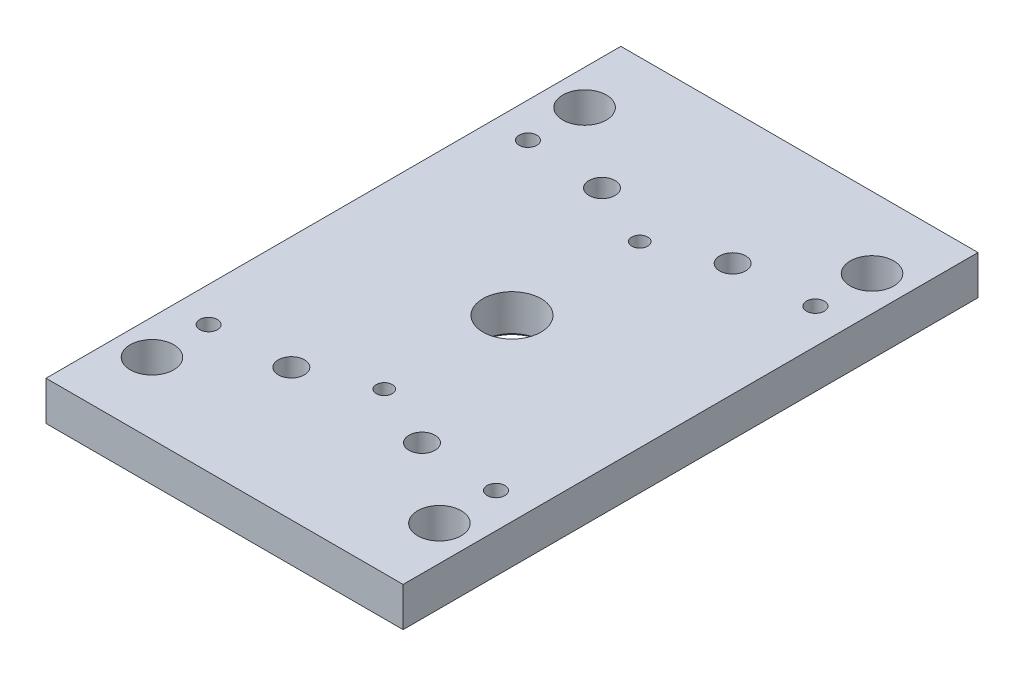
ISO-10303-21;
HEADER;
FILE_DESCRIPTION(('STEP AP214'),'2;1');
FILE_NAME('part.step','',(''),(''),'','','');
FILE_SCHEMA(('AUTOMOTIVE_DESIGN { 1 0 10303 214 1 1 1 1 }'));
ENDSEC;
DATA;
#1=APPLICATION_CONTEXT('core data for automotive mechanical design processes');
#2=APPLICATION_PROTOCOL_DEFINITION('international standard','automotive_design',2000,#1);
#3=PRODUCT_CONTEXT('',#1,'mechanical');
#4=PRODUCT('Part','Part','',(#3));
#5=PRODUCT_RELATED_PRODUCT_CATEGORY('part','',(#4));
#6=PRODUCT_DEFINITION_FORMATION('','',#4);
#7=PRODUCT_DEFINITION_CONTEXT('part definition',#1,'design');
#8=PRODUCT_DEFINITION('design','',#6,#7);
#9=PRODUCT_DEFINITION_SHAPE('','',#8);
#10=(LENGTH_UNIT() NAMED_UNIT(*) SI_UNIT(.MILLI.,.METRE.));
#11=(NAMED_UNIT(*) PLANE_ANGLE_UNIT() SI_UNIT($,.RADIAN.));
#12=(NAMED_UNIT(*) SI_UNIT($,.STERADIAN.) SOLID_ANGLE_UNIT());
#13=UNCERTAINTY_MEASURE_WITH_UNIT(LENGTH_MEASURE(1.E-05),#10,'distance_accuracy_value','');
#14=(GEOMETRIC_REPRESENTATION_CONTEXT(3) GLOBAL_UNCERTAINTY_ASSIGNED_CONTEXT((#13)) GLOBAL_UNIT_ASSIGNED_CONTEXT((#10,
#11,#12)) REPRESENTATION_CONTEXT('',''));
#15=CARTESIAN_POINT('',(0.,0.,0.));
#16=DIRECTION('',(0.,0.,1.));
#17=DIRECTION('',(1.,0.,0.));
#18=AXIS2_PLACEMENT_3D('',#15,#16,#17);
#19=CARTESIAN_POINT('',(-33.868,-153.,160.868));
#20=DIRECTION('',(0.,1.,0.));
#21=DIRECTION('',(-1.,0.,0.));
#22=AXIS2_PLACEMENT_3D('',#19,#20,#21);
#23=PLANE('',#22);
#24=CARTESIAN_POINT('',(-45.,-153.,172.));
#25=DIRECTION('',(0.,1.,0.));
#26=DIRECTION('',(0.,0.,1.));
#27=AXIS2_PLACEMENT_3D('',#24,#25,#26);
#28=CIRCLE('',#27,8.99999999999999);
#29=CARTESIAN_POINT('',(-45.,-153.,181.));
#30=VERTEX_POINT('',#29);
#31=EDGE_CURVE('E206',#30,#30,#28,.F.);
#32=ORIENTED_EDGE('',*,*,#31,.F.);
#33=EDGE_LOOP('',(#32));
#34=FACE_BOUND('',#33,.T.);
#35=CARTESIAN_POINT('',(-45.,-153.,172.));
#36=DIRECTION('',(0.,1.,0.));
#37=DIRECTION('',(0.,0.,1.));
#38=AXIS2_PLACEMENT_3D('',#35,#36,#37);
#39=CIRCLE('',#38,11.);
#40=CARTESIAN_POINT('',(-45.,-153.,183.));
#41=VERTEX_POINT('',#40);
#42=EDGE_CURVE('E20',#41,#41,#39,.T.);
#43=ORIENTED_EDGE('',*,*,#42,.F.);
#44=EDGE_LOOP('',(#43));
#45=FACE_BOUND('',#44,.T.);
#46=ADVANCED_FACE('F16',(#34,#45),#23,.F.);
#47=CARTESIAN_POINT('',(33.868,-153.,183.132));
#48=DIRECTION('',(0.,1.,0.));
#49=DIRECTION('',(1.,0.,0.));
#50=AXIS2_PLACEMENT_3D('',#47,#48,#49);
#51=PLANE('',#50);
#52=CARTESIAN_POINT('',(45.,-153.,172.));
#53=DIRECTION('',(0.,1.,0.));
#54=DIRECTION('',(0.,0.,1.));
#55=AXIS2_PLACEMENT_3D('',#52,#53,#54);
#56=CIRCLE('',#55,9.);
#57=CARTESIAN_POINT('',(45.,-153.,181.));
#58=VERTEX_POINT('',#57);
#59=EDGE_CURVE('E203',#58,#58,#56,.F.);
#60=ORIENTED_EDGE('',*,*,#59,.F.);
#61=EDGE_LOOP('',(#60));
#62=FACE_BOUND('',#61,.T.);
#63=CARTESIAN_POINT('',(45.,-153.,172.));
#64=DIRECTION('',(0.,1.,0.));
#65=DIRECTION('',(0.,0.,1.));
#66=AXIS2_PLACEMENT_3D('',#63,#64,#65);
#67=CIRCLE('',#66,11.);
#68=CARTESIAN_POINT('',(45.,-153.,183.));
#69=VERTEX_POINT('',#68);
#70=EDGE_CURVE('E209',#69,#69,#67,.T.);
#71=ORIENTED_EDGE('',*,*,#70,.F.);
#72=EDGE_LOOP('',(#71));
#73=FACE_BOUND('',#72,.T.);
#74=ADVANCED_FACE('F242',(#62,#73),#51,.F.);
#75=CARTESIAN_POINT('',(-8.602,-148.,161.602));
#76=DIRECTION('',(0.,1.,0.));
#77=DIRECTION('',(1.,0.,0.));
#78=AXIS2_PLACEMENT_3D('',#75,#76,#77);
#79=PLANE('',#78);
#80=CARTESIAN_POINT('',(0.,-148.,153.));
#81=DIRECTION('',(0.,-1.,0.));
#82=DIRECTION('',(0.,0.,-1.));
#83=AXIS2_PLACEMENT_3D('',#80,#81,#82);
#84=CIRCLE('',#83,5.5);
#85=CARTESIAN_POINT('',(0.,-148.,147.5));
#86=VERTEX_POINT('',#85);
#87=EDGE_CURVE('E91',#86,#86,#84,.T.);
#88=ORIENTED_EDGE('',*,*,#87,.F.);
#89=EDGE_LOOP('',(#88));
#90=FACE_BOUND('',#89,.T.);
#91=CARTESIAN_POINT('',(0.,-148.,153.));
#92=DIRECTION('',(0.,-1.,0.));
#93=DIRECTION('',(0.,0.,-1.));
#94=AXIS2_PLACEMENT_3D('',#91,#92,#93);
#95=CIRCLE('',#94,8.5);
#96=CARTESIAN_POINT('',(0.,-148.,144.5));
#97=VERTEX_POINT('',#96);
#98=EDGE_CURVE('E232',#97,#97,#95,.F.);
#99=ORIENTED_EDGE('',*,*,#98,.F.);
#100=EDGE_LOOP('',(#99));
#101=FACE_BOUND('',#100,.T.);
#102=ADVANCED_FACE('F249',(#90,#101),#79,.F.);
#103=CARTESIAN_POINT('',(-8.602,-148.,-14.398));
#104=DIRECTION('',(0.,1.,0.));
#105=DIRECTION('',(1.,0.,0.));
#106=AXIS2_PLACEMENT_3D('',#103,#104,#105);
#107=PLANE('',#106);
#108=CARTESIAN_POINT('',(0.,-148.,-23.));
#109=DIRECTION('',(0.,-1.,0.));
#110=DIRECTION('',(0.,0.,-1.));
#111=AXIS2_PLACEMENT_3D('',#108,#109,#110);
#112=CIRCLE('',#111,5.5);
#113=CARTESIAN_POINT('',(0.,-148.,-28.5));
#114=VERTEX_POINT('',#113);
#115=EDGE_CURVE('E90',#114,#114,#112,.T.);
#116=ORIENTED_EDGE('',*,*,#115,.F.);
#117=EDGE_LOOP('',(#116));
#118=FACE_BOUND('',#117,.T.);
#119=CARTESIAN_POINT('',(0.,-148.,-23.));
#120=DIRECTION('',(0.,-1.,0.));
#121=DIRECTION('',(0.,0.,-1.));
#122=AXIS2_PLACEMENT_3D('',#119,#120,#121);
#123=CIRCLE('',#122,8.5);
#124=CARTESIAN_POINT('',(0.,-148.,-31.5));
#125=VERTEX_POINT('',#124);
#126=EDGE_CURVE('E230',#125,#125,#123,.F.);
#127=ORIENTED_EDGE('',*,*,#126,.F.);
#128=EDGE_LOOP('',(#127));
#129=FACE_BOUND('',#128,.T.);
#130=ADVANCED_FACE('F587',(#118,#129),#107,.F.);
#131=CARTESIAN_POINT('',(-33.868,-153.,-53.132));
#132=DIRECTION('',(0.,1.,0.));
#133=DIRECTION('',(-1.,0.,0.));
#134=AXIS2_PLACEMENT_3D('',#131,#132,#133);
#135=PLANE('',#134);
#136=CARTESIAN_POINT('',(-45.,-153.,-42.));
#137=DIRECTION('',(0.,1.,0.));
#138=DIRECTION('',(0.,0.,1.));
#139=AXIS2_PLACEMENT_3D('',#136,#137,#138);
#140=CIRCLE('',#139,8.99999999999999);
#141=CARTESIAN_POINT('',(-45.,-153.,-33.));
#142=VERTEX_POINT('',#141);
#143=EDGE_CURVE('E196',#142,#142,#140,.F.);
#144=ORIENTED_EDGE('',*,*,#143,.F.);
#145=EDGE_LOOP('',(#144));
#146=FACE_BOUND('',#145,.T.);
#147=CARTESIAN_POINT('',(-45.,-153.,-42.));
#148=DIRECTION('',(0.,1.,0.));
#149=DIRECTION('',(0.,0.,1.));
#150=AXIS2_PLACEMENT_3D('',#147,#148,#149);
#151=CIRCLE('',#150,11.);
#152=CARTESIAN_POINT('',(-45.,-153.,-31.));
#153=VERTEX_POINT('',#152);
#154=EDGE_CURVE('E212',#153,#153,#151,.T.);
#155=ORIENTED_EDGE('',*,*,#154,.F.);
#156=EDGE_LOOP('',(#155));
#157=FACE_BOUND('',#156,.T.);
#158=ADVANCED_FACE('F579',(#146,#157),#135,.F.);
#159=CARTESIAN_POINT('',(33.868,-153.,-30.868));
#160=DIRECTION('',(0.,1.,0.));
#161=DIRECTION('',(1.,0.,0.));
#162=AXIS2_PLACEMENT_3D('',#159,#160,#161);
#163=PLANE('',#162);
#164=CARTESIAN_POINT('',(45.,-153.,-42.));
#165=DIRECTION('',(0.,1.,0.));
#166=DIRECTION('',(0.,0.,1.));
#167=AXIS2_PLACEMENT_3D('',#164,#165,#166);
#168=CIRCLE('',#167,9.);
#169=CARTESIAN_POINT('',(45.,-153.,-33.));
#170=VERTEX_POINT('',#169);
#171=EDGE_CURVE('E193',#170,#170,#168,.F.);
#172=ORIENTED_EDGE('',*,*,#171,.F.);
#173=EDGE_LOOP('',(#172));
#174=FACE_BOUND('',#173,.T.);
#175=CARTESIAN_POINT('',(45.,-153.,-42.));
#176=DIRECTION('',(0.,1.,0.));
#177=DIRECTION('',(0.,0.,1.));
#178=AXIS2_PLACEMENT_3D('',#175,#176,#177);
#179=CIRCLE('',#178,11.);
#180=CARTESIAN_POINT('',(45.,-153.,-31.));
#181=VERTEX_POINT('',#180);
#182=EDGE_CURVE('E215',#181,#181,#179,.T.);
#183=ORIENTED_EDGE('',*,*,#182,.F.);
#184=EDGE_LOOP('',(#183));
#185=FACE_BOUND('',#184,.T.);
#186=ADVANCED_FACE('F571',(#174,#185),#163,.F.);
#187=CARTESIAN_POINT('',(-108.2092,-147.,184.2092));
#188=DIRECTION('',(0.,1.,0.));
#189=DIRECTION('',(1.,0.,0.));
#190=AXIS2_PLACEMENT_3D('',#187,#188,#189);
#191=PLANE('',#190);
#192=CARTESIAN_POINT('',(-99.,-147.,175.));
#193=DIRECTION('',(0.,-1.,0.));
#194=DIRECTION('',(0.,0.,-1.));
#195=AXIS2_PLACEMENT_3D('',#192,#193,#194);
#196=CIRCLE('',#195,6.09999999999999);
#197=CARTESIAN_POINT('',(-99.,-147.,168.9));
#198=VERTEX_POINT('',#197);
#199=EDGE_CURVE('E190',#198,#198,#196,.T.);
#200=ORIENTED_EDGE('',*,*,#199,.F.);
#201=EDGE_LOOP('',(#200));
#202=FACE_BOUND('',#201,.T.);
#203=CARTESIAN_POINT('',(-99.,-147.,175.));
#204=DIRECTION('',(0.,-1.,0.));
#205=DIRECTION('',(0.,0.,-1.));
#206=AXIS2_PLACEMENT_3D('',#203,#204,#205);
#207=CIRCLE('',#206,9.1);
#208=CARTESIAN_POINT('',(-99.,-147.,165.9));
#209=VERTEX_POINT('',#208);
#210=EDGE_CURVE('E218',#209,#209,#207,.F.);
#211=ORIENTED_EDGE('',*,*,#210,.F.);
#212=EDGE_LOOP('',(#211));
#213=FACE_BOUND('',#212,.T.);
#214=ADVANCED_FACE('F563',(#202,#213),#191,.F.);
#215=CARTESIAN_POINT('',(89.7908,-147.,184.2092));
#216=DIRECTION('',(0.,1.,0.));
#217=DIRECTION('',(1.,0.,0.));
#218=AXIS2_PLACEMENT_3D('',#215,#216,#217);
#219=PLANE('',#218);
#220=CARTESIAN_POINT('',(99.,-147.,175.));
#221=DIRECTION('',(0.,-1.,0.));
#222=DIRECTION('',(0.,0.,-1.));
#223=AXIS2_PLACEMENT_3D('',#220,#221,#222);
#224=CIRCLE('',#223,6.09999999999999);
#225=CARTESIAN_POINT('',(99.,-147.,168.9));
#226=VERTEX_POINT('',#225);
#227=EDGE_CURVE('E187',#226,#226,#224,.T.);
#228=ORIENTED_EDGE('',*,*,#227,.F.);
#229=EDGE_LOOP('',(#228));
#230=FACE_BOUND('',#229,.T.);
#231=CARTESIAN_POINT('',(99.,-147.,175.));
#232=DIRECTION('',(0.,-1.,0.));
#233=DIRECTION('',(0.,0.,-1.));
#234=AXIS2_PLACEMENT_3D('',#231,#232,#233);
#235=CIRCLE('',#234,9.1);
#236=CARTESIAN_POINT('',(99.,-147.,165.9));
#237=VERTEX_POINT('',#236);
#238=EDGE_CURVE('E221',#237,#237,#235,.F.);
#239=ORIENTED_EDGE('',*,*,#238,.F.);
#240=EDGE_LOOP('',(#239));
#241=FACE_BOUND('',#240,.T.);
#242=ADVANCED_FACE('F555',(#230,#241),#219,.F.);
#243=CARTESIAN_POINT('',(89.7908,-147.,-35.7908));
#244=DIRECTION('',(0.,1.,0.));
#245=DIRECTION('',(1.,0.,0.));
#246=AXIS2_PLACEMENT_3D('',#243,#244,#245);
#247=PLANE('',#246);
#248=CARTESIAN_POINT('',(99.,-147.,-45.));
#249=DIRECTION('',(0.,-1.,0.));
#250=DIRECTION('',(0.,0.,-1.));
#251=AXIS2_PLACEMENT_3D('',#248,#249,#250);
#252=CIRCLE('',#251,6.09999999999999);
#253=CARTESIAN_POINT('',(99.,-147.,-51.1));
#254=VERTEX_POINT('',#253);
#255=EDGE_CURVE('E184',#254,#254,#252,.T.);
#256=ORIENTED_EDGE('',*,*,#255,.F.);
#257=EDGE_LOOP('',(#256));
#258=FACE_BOUND('',#257,.T.);
#259=CARTESIAN_POINT('',(99.,-147.,-45.));
#260=DIRECTION('',(0.,-1.,0.));
#261=DIRECTION('',(0.,0.,-1.));
#262=AXIS2_PLACEMENT_3D('',#259,#260,#261);
#263=CIRCLE('',#262,9.1);
#264=CARTESIAN_POINT('',(99.,-147.,-54.1));
#265=VERTEX_POINT('',#264);
#266=EDGE_CURVE('E224',#265,#265,#263,.F.);
#267=ORIENTED_EDGE('',*,*,#266,.F.);
#268=EDGE_LOOP('',(#267));
#269=FACE_BOUND('',#268,.T.);
#270=ADVANCED_FACE('F373',(#258,#269),#247,.F.);
#271=CARTESIAN_POINT('',(-108.2092,-147.,-35.7908));
#272=DIRECTION('',(0.,1.,0.));
#273=DIRECTION('',(1.,0.,0.));
#274=AXIS2_PLACEMENT_3D('',#271,#272,#273);
#275=PLANE('',#274);
#276=CARTESIAN_POINT('',(-99.,-147.,-45.));
#277=DIRECTION('',(0.,-1.,0.));
#278=DIRECTION('',(0.,0.,-1.));
#279=AXIS2_PLACEMENT_3D('',#276,#277,#278);
#280=CIRCLE('',#279,6.09999999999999);
#281=CARTESIAN_POINT('',(-99.,-147.,-51.1));
#282=VERTEX_POINT('',#281);
#283=EDGE_CURVE('E70',#282,#282,#280,.T.);
#284=ORIENTED_EDGE('',*,*,#283,.F.);
#285=EDGE_LOOP('',(#284));
#286=FACE_BOUND('',#285,.T.);
#287=CARTESIAN_POINT('',(-99.,-147.,-45.));
#288=DIRECTION('',(0.,-1.,0.));
#289=DIRECTION('',(0.,0.,-1.));
#290=AXIS2_PLACEMENT_3D('',#287,#288,#289);
#291=CIRCLE('',#290,9.1);
#292=CARTESIAN_POINT('',(-99.,-147.,-54.1));
#293=VERTEX_POINT('',#292);
#294=EDGE_CURVE('E227',#293,#293,#291,.F.);
#295=ORIENTED_EDGE('',*,*,#294,.F.);
#296=EDGE_LOOP('',(#295));
#297=FACE_BOUND('',#296,.T.);
#298=ADVANCED_FACE('F368',(#286,#297),#275,.F.);
#299=CARTESIAN_POINT('',(-45.,-159.,172.));
#300=DIRECTION('',(0.,1.,0.));
#301=DIRECTION('',(0.,0.,1.));
#302=AXIS2_PLACEMENT_3D('',#299,#300,#301);
#303=CYLINDRICAL_SURFACE('',#302,11.);
#304=CARTESIAN_POINT('',(-45.,-159.,172.));
#305=DIRECTION('',(0.,1.,0.));
#306=DIRECTION('',(0.,0.,1.));
#307=AXIS2_PLACEMENT_3D('',#304,#305,#306);
#308=CIRCLE('',#307,11.);
#309=CARTESIAN_POINT('',(-45.,-159.,183.));
#310=VERTEX_POINT('',#309);
#311=EDGE_CURVE('E69',#310,#310,#308,.T.);
#312=ORIENTED_EDGE('',*,*,#311,.F.);
#313=EDGE_LOOP('',(#312));
#314=FACE_BOUND('',#313,.T.);
#315=ORIENTED_EDGE('',*,*,#42,.T.);
#316=EDGE_LOOP('',(#315));
#317=FACE_BOUND('',#316,.T.);
#318=ADVANCED_FACE('F239',(#314,#317),#303,.F.);
#319=CARTESIAN_POINT('',(0.,-148.,153.));
#320=DIRECTION('',(0.,-1.,0.));
#321=DIRECTION('',(0.,0.,-1.));
#322=AXIS2_PLACEMENT_3D('',#319,#320,#321);
#323=CYLINDRICAL_SURFACE('',#322,8.5);
#324=ORIENTED_EDGE('',*,*,#98,.T.);
#325=EDGE_LOOP('',(#324));
#326=FACE_BOUND('',#325,.T.);
#327=CARTESIAN_POINT('',(0.,-159.,153.));
#328=DIRECTION('',(0.,-1.,0.));
#329=DIRECTION('',(0.,0.,-1.));
#330=AXIS2_PLACEMENT_3D('',#327,#328,#329);
#331=CIRCLE('',#330,8.5);
#332=CARTESIAN_POINT('',(0.,-159.,144.5));
#333=VERTEX_POINT('',#332);
#334=EDGE_CURVE('E177',#333,#333,#331,.F.);
#335=ORIENTED_EDGE('',*,*,#334,.F.);
#336=EDGE_LOOP('',(#335));
#337=FACE_BOUND('',#336,.T.);
#338=ADVANCED_FACE('F364',(#326,#337),#323,.F.);
#339=CARTESIAN_POINT('',(0.,-148.,-23.));
#340=DIRECTION('',(0.,-1.,0.));
#341=DIRECTION('',(0.,0.,-1.));
#342=AXIS2_PLACEMENT_3D('',#339,#340,#341);
#343=CYLINDRICAL_SURFACE('',#342,8.5);
#344=ORIENTED_EDGE('',*,*,#126,.T.);
#345=EDGE_LOOP('',(#344));
#346=FACE_BOUND('',#345,.T.);
#347=CARTESIAN_POINT('',(0.,-159.,-23.));
#348=DIRECTION('',(0.,-1.,0.));
#349=DIRECTION('',(0.,0.,-1.));
#350=AXIS2_PLACEMENT_3D('',#347,#348,#349);
#351=CIRCLE('',#350,8.5);
#352=CARTESIAN_POINT('',(0.,-159.,-31.5));
#353=VERTEX_POINT('',#352);
#354=EDGE_CURVE('E174',#353,#353,#351,.F.);
#355=ORIENTED_EDGE('',*,*,#354,.F.);
#356=EDGE_LOOP('',(#355));
#357=FACE_BOUND('',#356,.T.);
#358=ADVANCED_FACE('F360',(#346,#357),#343,.F.);
#359=CARTESIAN_POINT('',(-99.,-147.,-45.));
#360=DIRECTION('',(0.,-1.,0.));
#361=DIRECTION('',(0.,0.,-1.));
#362=AXIS2_PLACEMENT_3D('',#359,#360,#361);
#363=CYLINDRICAL_SURFACE('',#362,9.1);
#364=ORIENTED_EDGE('',*,*,#294,.T.);
#365=EDGE_LOOP('',(#364));
#366=FACE_BOUND('',#365,.T.);
#367=CARTESIAN_POINT('',(-99.,-159.,-45.));
#368=DIRECTION('',(0.,-1.,0.));
#369=DIRECTION('',(0.,0.,-1.));
#370=AXIS2_PLACEMENT_3D('',#367,#368,#369);
#371=CIRCLE('',#370,9.1);
#372=CARTESIAN_POINT('',(-99.,-159.,-54.1));
#373=VERTEX_POINT('',#372);
#374=EDGE_CURVE('E171',#373,#373,#371,.F.);
#375=ORIENTED_EDGE('',*,*,#374,.F.);
#376=EDGE_LOOP('',(#375));
#377=FACE_BOUND('',#376,.T.);
#378=ADVANCED_FACE('F356',(#366,#377),#363,.F.);
#379=CARTESIAN_POINT('',(99.,-147.,-45.));
#380=DIRECTION('',(0.,-1.,0.));
#381=DIRECTION('',(0.,0.,-1.));
#382=AXIS2_PLACEMENT_3D('',#379,#380,#381);
#383=CYLINDRICAL_SURFACE('',#382,9.1);
#384=ORIENTED_EDGE('',*,*,#266,.T.);
#385=EDGE_LOOP('',(#384));
#386=FACE_BOUND('',#385,.T.);
#387=CARTESIAN_POINT('',(99.,-159.,-45.));
#388=DIRECTION('',(0.,-1.,0.));
#389=DIRECTION('',(0.,0.,-1.));
#390=AXIS2_PLACEMENT_3D('',#387,#388,#389);
#391=CIRCLE('',#390,9.1);
#392=CARTESIAN_POINT('',(99.,-159.,-54.1));
#393=VERTEX_POINT('',#392);
#394=EDGE_CURVE('E162',#393,#393,#391,.F.);
#395=ORIENTED_EDGE('',*,*,#394,.F.);
#396=EDGE_LOOP('',(#395));
#397=FACE_BOUND('',#396,.T.);
#398=ADVANCED_FACE('F352',(#386,#397),#383,.F.);
#399=CARTESIAN_POINT('',(99.,-147.,175.));
#400=DIRECTION('',(0.,-1.,0.));
#401=DIRECTION('',(0.,0.,-1.));
#402=AXIS2_PLACEMENT_3D('',#399,#400,#401);
#403=CYLINDRICAL_SURFACE('',#402,9.1);
#404=ORIENTED_EDGE('',*,*,#238,.T.);
#405=EDGE_LOOP('',(#404));
#406=FACE_BOUND('',#405,.T.);
#407=CARTESIAN_POINT('',(99.,-159.,175.));
#408=DIRECTION('',(0.,-1.,0.));
#409=DIRECTION('',(0.,0.,-1.));
#410=AXIS2_PLACEMENT_3D('',#407,#408,#409);
#411=CIRCLE('',#410,9.1);
#412=CARTESIAN_POINT('',(99.,-159.,165.9));
#413=VERTEX_POINT('',#412);
#414=EDGE_CURVE('E156',#413,#413,#411,.F.);
#415=ORIENTED_EDGE('',*,*,#414,.F.);
#416=EDGE_LOOP('',(#415));
#417=FACE_BOUND('',#416,.T.);
#418=ADVANCED_FACE('F348',(#406,#417),#403,.F.);
#419=CARTESIAN_POINT('',(-99.,-147.,175.));
#420=DIRECTION('',(0.,-1.,0.));
#421=DIRECTION('',(0.,0.,-1.));
#422=AXIS2_PLACEMENT_3D('',#419,#420,#421);
#423=CYLINDRICAL_SURFACE('',#422,9.1);
#424=ORIENTED_EDGE('',*,*,#210,.T.);
#425=EDGE_LOOP('',(#424));
#426=FACE_BOUND('',#425,.T.);
#427=CARTESIAN_POINT('',(-99.,-159.,175.));
#428=DIRECTION('',(0.,-1.,0.));
#429=DIRECTION('',(0.,0.,-1.));
#430=AXIS2_PLACEMENT_3D('',#427,#428,#429);
#431=CIRCLE('',#430,9.1);
#432=CARTESIAN_POINT('',(-99.,-159.,165.9));
#433=VERTEX_POINT('',#432);
#434=EDGE_CURVE('E153',#433,#433,#431,.F.);
#435=ORIENTED_EDGE('',*,*,#434,.F.);
#436=EDGE_LOOP('',(#435));
#437=FACE_BOUND('',#436,.T.);
#438=ADVANCED_FACE('F344',(#426,#437),#423,.F.);
#439=CARTESIAN_POINT('',(45.,-159.,-42.));
#440=DIRECTION('',(0.,1.,0.));
#441=DIRECTION('',(0.,0.,1.));
#442=AXIS2_PLACEMENT_3D('',#439,#440,#441);
#443=CYLINDRICAL_SURFACE('',#442,11.);
#444=CARTESIAN_POINT('',(45.,-159.,-42.));
#445=DIRECTION('',(0.,1.,0.));
#446=DIRECTION('',(0.,0.,1.));
#447=AXIS2_PLACEMENT_3D('',#444,#445,#446);
#448=CIRCLE('',#447,11.);
#449=CARTESIAN_POINT('',(45.,-159.,-31.));
#450=VERTEX_POINT('',#449);
#451=EDGE_CURVE('E147',#450,#450,#448,.T.);
#452=ORIENTED_EDGE('',*,*,#451,.F.);
#453=EDGE_LOOP('',(#452));
#454=FACE_BOUND('',#453,.T.);
#455=ORIENTED_EDGE('',*,*,#182,.T.);
#456=EDGE_LOOP('',(#455));
#457=FACE_BOUND('',#456,.T.);
#458=ADVANCED_FACE('F340',(#454,#457),#443,.F.);
#459=CARTESIAN_POINT('',(-45.,-159.,-42.));
#460=DIRECTION('',(0.,1.,0.));
#461=DIRECTION('',(0.,0.,1.));
#462=AXIS2_PLACEMENT_3D('',#459,#460,#461);
#463=CYLINDRICAL_SURFACE('',#462,11.);
#464=ORIENTED_EDGE('',*,*,#154,.T.);
#465=EDGE_LOOP('',(#464));
#466=FACE_BOUND('',#465,.T.);
#467=CARTESIAN_POINT('',(-45.,-159.,-42.));
#468=DIRECTION('',(0.,1.,0.));
#469=DIRECTION('',(0.,0.,1.));
#470=AXIS2_PLACEMENT_3D('',#467,#468,#469);
#471=CIRCLE('',#470,11.);
#472=CARTESIAN_POINT('',(-45.,-159.,-31.));
#473=VERTEX_POINT('',#472);
#474=EDGE_CURVE('E144',#473,#473,#471,.T.);
#475=ORIENTED_EDGE('',*,*,#474,.F.);
#476=EDGE_LOOP('',(#475));
#477=FACE_BOUND('',#476,.T.);
#478=ADVANCED_FACE('F336',(#466,#477),#463,.F.);
#479=CARTESIAN_POINT('',(0.,-157.,65.));
#480=DIRECTION('',(0.,-1.,0.));
#481=DIRECTION('',(0.,0.,-1.));
#482=AXIS2_PLACEMENT_3D('',#479,#480,#481);
#483=CONICAL_SURFACE('',#482,20.,0.785398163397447);
#484=CARTESIAN_POINT('',(0.,-157.,65.));
#485=DIRECTION('',(0.,-1.,0.));
#486=DIRECTION('',(-1.,0.,0.));
#487=AXIS2_PLACEMENT_3D('',#484,#485,#486);
#488=CIRCLE('',#487,20.);
#489=CARTESIAN_POINT('',(-20.,-157.,65.));
#490=VERTEX_POINT('',#489);
#491=EDGE_CURVE('E88',#490,#490,#488,.T.);
#492=ORIENTED_EDGE('',*,*,#491,.F.);
#493=EDGE_LOOP('',(#492));
#494=FACE_BOUND('',#493,.T.);
#495=CARTESIAN_POINT('',(0.,-159.,65.));
#496=DIRECTION('',(0.,-1.,0.));
#497=DIRECTION('',(0.,0.,-1.));
#498=AXIS2_PLACEMENT_3D('',#495,#496,#497);
#499=CIRCLE('',#498,22.);
#500=CARTESIAN_POINT('',(0.,-159.,43.));
#501=VERTEX_POINT('',#500);
#502=EDGE_CURVE('E141',#501,#501,#499,.F.);
#503=ORIENTED_EDGE('',*,*,#502,.F.);
#504=EDGE_LOOP('',(#503));
#505=FACE_BOUND('',#504,.T.);
#506=ADVANCED_FACE('F332',(#494,#505),#483,.F.);
#507=CARTESIAN_POINT('',(45.,-159.,172.));
#508=DIRECTION('',(0.,1.,0.));
#509=DIRECTION('',(0.,0.,1.));
#510=AXIS2_PLACEMENT_3D('',#507,#508,#509);
#511=CYLINDRICAL_SURFACE('',#510,11.);
#512=ORIENTED_EDGE('',*,*,#70,.T.);
#513=EDGE_LOOP('',(#512));
#514=FACE_BOUND('',#513,.T.);
#515=CARTESIAN_POINT('',(45.,-159.,172.));
#516=DIRECTION('',(0.,1.,0.));
#517=DIRECTION('',(0.,0.,1.));
#518=AXIS2_PLACEMENT_3D('',#515,#516,#517);
#519=CIRCLE('',#518,11.);
#520=CARTESIAN_POINT('',(45.,-159.,183.));
#521=VERTEX_POINT('',#520);
#522=EDGE_CURVE('E78',#521,#521,#519,.T.);
#523=ORIENTED_EDGE('',*,*,#522,.F.);
#524=EDGE_LOOP('',(#523));
#525=FACE_BOUND('',#524,.T.);
#526=ADVANCED_FACE('F328',(#514,#525),#511,.F.);
#527=CARTESIAN_POINT('',(-45.,-153.,172.));
#528=DIRECTION('',(0.,1.,0.));
#529=DIRECTION('',(0.,0.,1.));
#530=AXIS2_PLACEMENT_3D('',#527,#528,#529);
#531=CYLINDRICAL_SURFACE('',#530,8.99999999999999);
#532=CARTESIAN_POINT('',(-45.,-132.,172.));
#533=DIRECTION('',(0.,1.,0.));
#534=DIRECTION('',(0.,0.,1.));
#535=AXIS2_PLACEMENT_3D('',#532,#533,#534);
#536=CIRCLE('',#535,8.99999999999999);
#537=CARTESIAN_POINT('',(-45.,-132.,181.));
#538=VERTEX_POINT('',#537);
#539=EDGE_CURVE('E136',#538,#538,#536,.F.);
#540=ORIENTED_EDGE('',*,*,#539,.F.);
#541=EDGE_LOOP('',(#540));
#542=FACE_BOUND('',#541,.T.);
#543=ORIENTED_EDGE('',*,*,#31,.T.);
#544=EDGE_LOOP('',(#543));
#545=FACE_BOUND('',#544,.T.);
#546=ADVANCED_FACE('F324',(#542,#545),#531,.F.);
#547=CARTESIAN_POINT('',(45.,-153.,172.));
#548=DIRECTION('',(0.,1.,0.));
#549=DIRECTION('',(0.,0.,1.));
#550=AXIS2_PLACEMENT_3D('',#547,#548,#549);
#551=CYLINDRICAL_SURFACE('',#550,9.);
#552=CARTESIAN_POINT('',(45.,-132.,172.));
#553=DIRECTION('',(0.,1.,0.));
#554=DIRECTION('',(0.,0.,1.));
#555=AXIS2_PLACEMENT_3D('',#552,#553,#554);
#556=CIRCLE('',#555,9.);
#557=CARTESIAN_POINT('',(45.,-132.,181.));
#558=VERTEX_POINT('',#557);
#559=EDGE_CURVE('E133',#558,#558,#556,.F.);
#560=ORIENTED_EDGE('',*,*,#559,.F.);
#561=EDGE_LOOP('',(#560));
#562=FACE_BOUND('',#561,.T.);
#563=ORIENTED_EDGE('',*,*,#59,.T.);
#564=EDGE_LOOP('',(#563));
#565=FACE_BOUND('',#564,.T.);
#566=ADVANCED_FACE('F320',(#562,#565),#551,.F.);
#567=CARTESIAN_POINT('',(0.,-132.,153.));
#568=DIRECTION('',(0.,-1.,0.));
#569=DIRECTION('',(0.,0.,-1.));
#570=AXIS2_PLACEMENT_3D('',#567,#568,#569);
#571=CYLINDRICAL_SURFACE('',#570,5.5);
#572=CARTESIAN_POINT('',(0.,-132.,153.));
#573=DIRECTION('',(0.,-1.,0.));
#574=DIRECTION('',(0.,0.,-1.));
#575=AXIS2_PLACEMENT_3D('',#572,#573,#574);
#576=CIRCLE('',#575,5.5);
#577=CARTESIAN_POINT('',(0.,-132.,147.5));
#578=VERTEX_POINT('',#577);
#579=EDGE_CURVE('E130',#578,#578,#576,.T.);
#580=ORIENTED_EDGE('',*,*,#579,.F.);
#581=EDGE_LOOP('',(#580));
#582=FACE_BOUND('',#581,.T.);
#583=ORIENTED_EDGE('',*,*,#87,.T.);
#584=EDGE_LOOP('',(#583));
#585=FACE_BOUND('',#584,.T.);
#586=ADVANCED_FACE('F316',(#582,#585),#571,.F.);
#587=CARTESIAN_POINT('',(0.,-132.,65.));
#588=DIRECTION('',(0.,-1.,0.));
#589=DIRECTION('',(0.,0.,-1.));
#590=AXIS2_PLACEMENT_3D('',#587,#588,#589);
#591=CYLINDRICAL_SURFACE('',#590,20.);
#592=CARTESIAN_POINT('',(0.,-132.,65.));
#593=DIRECTION('',(0.,-1.,0.));
#594=DIRECTION('',(0.,0.,-1.));
#595=AXIS2_PLACEMENT_3D('',#592,#593,#594);
#596=CIRCLE('',#595,20.);
#597=CARTESIAN_POINT('',(0.,-132.,45.));
#598=VERTEX_POINT('',#597);
#599=EDGE_CURVE('E127',#598,#598,#596,.T.);
#600=ORIENTED_EDGE('',*,*,#599,.F.);
#601=EDGE_LOOP('',(#600));
#602=FACE_BOUND('',#601,.T.);
#603=ORIENTED_EDGE('',*,*,#491,.T.);
#604=EDGE_LOOP('',(#603));
#605=FACE_BOUND('',#604,.T.);
#606=ADVANCED_FACE('F312',(#602,#605),#591,.F.);
#607=CARTESIAN_POINT('',(0.,-132.,-23.));
#608=DIRECTION('',(0.,-1.,0.));
#609=DIRECTION('',(0.,0.,-1.));
#610=AXIS2_PLACEMENT_3D('',#607,#608,#609);
#611=CYLINDRICAL_SURFACE('',#610,5.5);
#612=CARTESIAN_POINT('',(0.,-132.,-23.));
#613=DIRECTION('',(0.,-1.,0.));
#614=DIRECTION('',(0.,0.,-1.));
#615=AXIS2_PLACEMENT_3D('',#612,#613,#614);
#616=CIRCLE('',#615,5.5);
#617=CARTESIAN_POINT('',(0.,-132.,-28.5));
#618=VERTEX_POINT('',#617);
#619=EDGE_CURVE('E124',#618,#618,#616,.T.);
#620=ORIENTED_EDGE('',*,*,#619,.F.);
#621=EDGE_LOOP('',(#620));
#622=FACE_BOUND('',#621,.T.);
#623=ORIENTED_EDGE('',*,*,#115,.T.);
#624=EDGE_LOOP('',(#623));
#625=FACE_BOUND('',#624,.T.);
#626=ADVANCED_FACE('F308',(#622,#625),#611,.F.);
#627=CARTESIAN_POINT('',(-45.,-153.,-42.));
#628=DIRECTION('',(0.,1.,0.));
#629=DIRECTION('',(0.,0.,1.));
#630=AXIS2_PLACEMENT_3D('',#627,#628,#629);
#631=CYLINDRICAL_SURFACE('',#630,8.99999999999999);
#632=CARTESIAN_POINT('',(-45.,-132.,-42.));
#633=DIRECTION('',(0.,1.,0.));
#634=DIRECTION('',(0.,0.,1.));
#635=AXIS2_PLACEMENT_3D('',#632,#633,#634);
#636=CIRCLE('',#635,8.99999999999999);
#637=CARTESIAN_POINT('',(-45.,-132.,-33.));
#638=VERTEX_POINT('',#637);
#639=EDGE_CURVE('E121',#638,#638,#636,.F.);
#640=ORIENTED_EDGE('',*,*,#639,.F.);
#641=EDGE_LOOP('',(#640));
#642=FACE_BOUND('',#641,.T.);
#643=ORIENTED_EDGE('',*,*,#143,.T.);
#644=EDGE_LOOP('',(#643));
#645=FACE_BOUND('',#644,.T.);
#646=ADVANCED_FACE('F304',(#642,#645),#631,.F.);
#647=CARTESIAN_POINT('',(45.,-153.,-42.));
#648=DIRECTION('',(0.,1.,0.));
#649=DIRECTION('',(0.,0.,1.));
#650=AXIS2_PLACEMENT_3D('',#647,#648,#649);
#651=CYLINDRICAL_SURFACE('',#650,9.);
#652=CARTESIAN_POINT('',(45.,-132.,-42.));
#653=DIRECTION('',(0.,1.,0.));
#654=DIRECTION('',(0.,0.,1.));
#655=AXIS2_PLACEMENT_3D('',#652,#653,#654);
#656=CIRCLE('',#655,9.);
#657=CARTESIAN_POINT('',(45.,-132.,-33.));
#658=VERTEX_POINT('',#657);
#659=EDGE_CURVE('E118',#658,#658,#656,.F.);
#660=ORIENTED_EDGE('',*,*,#659,.F.);
#661=EDGE_LOOP('',(#660));
#662=FACE_BOUND('',#661,.T.);
#663=ORIENTED_EDGE('',*,*,#171,.T.);
#664=EDGE_LOOP('',(#663));
#665=FACE_BOUND('',#664,.T.);
#666=ADVANCED_FACE('F300',(#662,#665),#651,.F.);
#667=CARTESIAN_POINT('',(-99.,-132.,214.));
#668=DIRECTION('',(0.,-1.,0.));
#669=DIRECTION('',(0.,0.,-1.));
#670=AXIS2_PLACEMENT_3D('',#667,#668,#669);
#671=CYLINDRICAL_SURFACE('',#670,15.);
#672=CARTESIAN_POINT('',(-99.,-132.,214.));
#673=DIRECTION('',(0.,-1.,0.));
#674=DIRECTION('',(0.,0.,-1.));
#675=AXIS2_PLACEMENT_3D('',#672,#673,#674);
#676=CIRCLE('',#675,15.);
#677=CARTESIAN_POINT('',(-99.,-132.,199.));
#678=VERTEX_POINT('',#677);
#679=EDGE_CURVE('E115',#678,#678,#676,.T.);
#680=ORIENTED_EDGE('',*,*,#679,.F.);
#681=EDGE_LOOP('',(#680));
#682=FACE_BOUND('',#681,.T.);
#683=CARTESIAN_POINT('',(-99.,-159.,214.));
#684=DIRECTION('',(0.,-1.,0.));
#685=DIRECTION('',(0.,0.,-1.));
#686=AXIS2_PLACEMENT_3D('',#683,#684,#685);
#687=CIRCLE('',#686,15.);
#688=CARTESIAN_POINT('',(-99.,-159.,199.));
#689=VERTEX_POINT('',#688);
#690=EDGE_CURVE('E150',#689,#689,#687,.F.);
#691=ORIENTED_EDGE('',*,*,#690,.F.);
#692=EDGE_LOOP('',(#691));
#693=FACE_BOUND('',#692,.T.);
#694=ADVANCED_FACE('F296',(#682,#693),#671,.F.);
#695=CARTESIAN_POINT('',(-99.,-132.,175.));
#696=DIRECTION('',(0.,-1.,0.));
#697=DIRECTION('',(0.,0.,-1.));
#698=AXIS2_PLACEMENT_3D('',#695,#696,#697);
#699=CYLINDRICAL_SURFACE('',#698,6.09999999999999);
#700=CARTESIAN_POINT('',(-99.,-132.,175.));
#701=DIRECTION('',(0.,-1.,0.));
#702=DIRECTION('',(0.,0.,-1.));
#703=AXIS2_PLACEMENT_3D('',#700,#701,#702);
#704=CIRCLE('',#703,6.09999999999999);
#705=CARTESIAN_POINT('',(-99.,-132.,168.9));
#706=VERTEX_POINT('',#705);
#707=EDGE_CURVE('E112',#706,#706,#704,.T.);
#708=ORIENTED_EDGE('',*,*,#707,.F.);
#709=EDGE_LOOP('',(#708));
#710=FACE_BOUND('',#709,.T.);
#711=ORIENTED_EDGE('',*,*,#199,.T.);
#712=EDGE_LOOP('',(#711));
#713=FACE_BOUND('',#712,.T.);
#714=ADVANCED_FACE('F292',(#710,#713),#699,.F.);
#715=CARTESIAN_POINT('',(99.,-132.,214.));
#716=DIRECTION('',(0.,-1.,0.));
#717=DIRECTION('',(0.,0.,-1.));
#718=AXIS2_PLACEMENT_3D('',#715,#716,#717);
#719=CYLINDRICAL_SURFACE('',#718,15.);
#720=CARTESIAN_POINT('',(99.,-132.,214.));
#721=DIRECTION('',(0.,-1.,0.));
#722=DIRECTION('',(0.,0.,-1.));
#723=AXIS2_PLACEMENT_3D('',#720,#721,#722);
#724=CIRCLE('',#723,15.);
#725=CARTESIAN_POINT('',(99.,-132.,199.));
#726=VERTEX_POINT('',#725);
#727=EDGE_CURVE('E109',#726,#726,#724,.T.);
#728=ORIENTED_EDGE('',*,*,#727,.F.);
#729=EDGE_LOOP('',(#728));
#730=FACE_BOUND('',#729,.T.);
#731=CARTESIAN_POINT('',(99.,-159.,214.));
#732=DIRECTION('',(0.,-1.,0.));
#733=DIRECTION('',(0.,0.,-1.));
#734=AXIS2_PLACEMENT_3D('',#731,#732,#733);
#735=CIRCLE('',#734,15.);
#736=CARTESIAN_POINT('',(99.,-159.,199.));
#737=VERTEX_POINT('',#736);
#738=EDGE_CURVE('E159',#737,#737,#735,.F.);
#739=ORIENTED_EDGE('',*,*,#738,.F.);
#740=EDGE_LOOP('',(#739));
#741=FACE_BOUND('',#740,.T.);
#742=ADVANCED_FACE('F288',(#730,#741),#719,.F.);
#743=CARTESIAN_POINT('',(99.,-132.,175.));
#744=DIRECTION('',(0.,-1.,0.));
#745=DIRECTION('',(0.,0.,-1.));
#746=AXIS2_PLACEMENT_3D('',#743,#744,#745);
#747=CYLINDRICAL_SURFACE('',#746,6.09999999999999);
#748=CARTESIAN_POINT('',(99.,-132.,175.));
#749=DIRECTION('',(0.,-1.,0.));
#750=DIRECTION('',(0.,0.,-1.));
#751=AXIS2_PLACEMENT_3D('',#748,#749,#750);
#752=CIRCLE('',#751,6.09999999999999);
#753=CARTESIAN_POINT('',(99.,-132.,168.9));
#754=VERTEX_POINT('',#753);
#755=EDGE_CURVE('E106',#754,#754,#752,.T.);
#756=ORIENTED_EDGE('',*,*,#755,.F.);
#757=EDGE_LOOP('',(#756));
#758=FACE_BOUND('',#757,.T.);
#759=ORIENTED_EDGE('',*,*,#227,.T.);
#760=EDGE_LOOP('',(#759));
#761=FACE_BOUND('',#760,.T.);
#762=ADVANCED_FACE('F284',(#758,#761),#747,.F.);
#763=CARTESIAN_POINT('',(99.,-132.,-45.));
#764=DIRECTION('',(0.,-1.,0.));
#765=DIRECTION('',(0.,0.,-1.));
#766=AXIS2_PLACEMENT_3D('',#763,#764,#765);
#767=CYLINDRICAL_SURFACE('',#766,6.09999999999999);
#768=CARTESIAN_POINT('',(99.,-132.,-45.));
#769=DIRECTION('',(0.,-1.,0.));
#770=DIRECTION('',(0.,0.,-1.));
#771=AXIS2_PLACEMENT_3D('',#768,#769,#770);
#772=CIRCLE('',#771,6.09999999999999);
#773=CARTESIAN_POINT('',(99.,-132.,-51.1));
#774=VERTEX_POINT('',#773);
#775=EDGE_CURVE('E103',#774,#774,#772,.T.);
#776=ORIENTED_EDGE('',*,*,#775,.F.);
#777=EDGE_LOOP('',(#776));
#778=FACE_BOUND('',#777,.T.);
#779=ORIENTED_EDGE('',*,*,#255,.T.);
#780=EDGE_LOOP('',(#779));
#781=FACE_BOUND('',#780,.T.);
#782=ADVANCED_FACE('F280',(#778,#781),#767,.F.);
#783=CARTESIAN_POINT('',(99.,-132.,-84.));
#784=DIRECTION('',(0.,-1.,0.));
#785=DIRECTION('',(0.,0.,-1.));
#786=AXIS2_PLACEMENT_3D('',#783,#784,#785);
#787=CYLINDRICAL_SURFACE('',#786,15.);
#788=CARTESIAN_POINT('',(99.,-132.,-84.));
#789=DIRECTION('',(0.,-1.,0.));
#790=DIRECTION('',(0.,0.,-1.));
#791=AXIS2_PLACEMENT_3D('',#788,#789,#790);
#792=CIRCLE('',#791,15.);
#793=CARTESIAN_POINT('',(99.,-132.,-99.));
#794=VERTEX_POINT('',#793);
#795=EDGE_CURVE('E100',#794,#794,#792,.T.);
#796=ORIENTED_EDGE('',*,*,#795,.F.);
#797=EDGE_LOOP('',(#796));
#798=FACE_BOUND('',#797,.T.);
#799=CARTESIAN_POINT('',(99.,-159.,-84.));
#800=DIRECTION('',(0.,-1.,0.));
#801=DIRECTION('',(0.,0.,-1.));
#802=AXIS2_PLACEMENT_3D('',#799,#800,#801);
#803=CIRCLE('',#802,15.);
#804=CARTESIAN_POINT('',(99.,-159.,-99.));
#805=VERTEX_POINT('',#804);
#806=EDGE_CURVE('E165',#805,#805,#803,.F.);
#807=ORIENTED_EDGE('',*,*,#806,.F.);
#808=EDGE_LOOP('',(#807));
#809=FACE_BOUND('',#808,.T.);
#810=ADVANCED_FACE('F276',(#798,#809),#787,.F.);
#811=CARTESIAN_POINT('',(-99.,-132.,-45.));
#812=DIRECTION('',(0.,-1.,0.));
#813=DIRECTION('',(0.,0.,-1.));
#814=AXIS2_PLACEMENT_3D('',#811,#812,#813);
#815=CYLINDRICAL_SURFACE('',#814,6.09999999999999);
#816=CARTESIAN_POINT('',(-99.,-132.,-45.));
#817=DIRECTION('',(0.,-1.,0.));
#818=DIRECTION('',(0.,0.,-1.));
#819=AXIS2_PLACEMENT_3D('',#816,#817,#818);
#820=CIRCLE('',#819,6.09999999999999);
#821=CARTESIAN_POINT('',(-99.,-132.,-51.1));
#822=VERTEX_POINT('',#821);
#823=EDGE_CURVE('E97',#822,#822,#820,.T.);
#824=ORIENTED_EDGE('',*,*,#823,.F.);
#825=EDGE_LOOP('',(#824));
#826=FACE_BOUND('',#825,.T.);
#827=ORIENTED_EDGE('',*,*,#283,.T.);
#828=EDGE_LOOP('',(#827));
#829=FACE_BOUND('',#828,.T.);
#830=ADVANCED_FACE('F272',(#826,#829),#815,.F.);
#831=CARTESIAN_POINT('',(-99.,-132.,-84.));
#832=DIRECTION('',(0.,-1.,0.));
#833=DIRECTION('',(0.,0.,-1.));
#834=AXIS2_PLACEMENT_3D('',#831,#832,#833);
#835=CYLINDRICAL_SURFACE('',#834,15.);
#836=CARTESIAN_POINT('',(-99.,-132.,-84.));
#837=DIRECTION('',(0.,-1.,0.));
#838=DIRECTION('',(0.,0.,-1.));
#839=AXIS2_PLACEMENT_3D('',#836,#837,#838);
#840=CIRCLE('',#839,15.);
#841=CARTESIAN_POINT('',(-99.,-132.,-99.));
#842=VERTEX_POINT('',#841);
#843=EDGE_CURVE('E93',#842,#842,#840,.T.);
#844=ORIENTED_EDGE('',*,*,#843,.F.);
#845=EDGE_LOOP('',(#844));
#846=FACE_BOUND('',#845,.T.);
#847=CARTESIAN_POINT('',(-99.,-159.,-84.));
#848=DIRECTION('',(0.,-1.,0.));
#849=DIRECTION('',(0.,0.,-1.));
#850=AXIS2_PLACEMENT_3D('',#847,#848,#849);
#851=CIRCLE('',#850,15.);
#852=CARTESIAN_POINT('',(-99.,-159.,-99.));
#853=VERTEX_POINT('',#852);
#854=EDGE_CURVE('E168',#853,#853,#851,.F.);
#855=ORIENTED_EDGE('',*,*,#854,.F.);
#856=EDGE_LOOP('',(#855));
#857=FACE_BOUND('',#856,.T.);
#858=ADVANCED_FACE('F269',(#846,#857),#835,.F.);
#859=CARTESIAN_POINT('',(123.,-132.,263.));
#860=DIRECTION('',(1.,0.,0.));
#861=DIRECTION('',(0.,-1.,0.));
#862=AXIS2_PLACEMENT_3D('',#859,#860,#861);
#863=PLANE('',#862);
#864=DIRECTION('',(0.,0.,1.));
#865=VECTOR('',#864,1.);
#866=CARTESIAN_POINT('',(123.,-159.,65.));
#867=LINE('',#866,#865);
#868=CARTESIAN_POINT('',(123.,-159.,-133.));
#869=VERTEX_POINT('',#868);
#870=CARTESIAN_POINT('',(123.,-159.,263.));
#871=VERTEX_POINT('',#870);
#872=EDGE_CURVE('E59',#869,#871,#867,.T.);
#873=ORIENTED_EDGE('',*,*,#872,.F.);
#874=DIRECTION('',(0.,-1.,0.));
#875=VECTOR('',#874,1.);
#876=CARTESIAN_POINT('',(123.,-145.5,-133.));
#877=LINE('',#876,#875);
#878=CARTESIAN_POINT('',(123.,-132.,-133.));
#879=VERTEX_POINT('',#878);
#880=EDGE_CURVE('E399',#879,#869,#877,.T.);
#881=ORIENTED_EDGE('',*,*,#880,.F.);
#882=DIRECTION('',(0.,0.,-1.));
#883=VECTOR('',#882,1.);
#884=CARTESIAN_POINT('',(123.,-132.,65.));
#885=LINE('',#884,#883);
#886=CARTESIAN_POINT('',(123.,-132.,263.));
#887=VERTEX_POINT('',#886);
#888=EDGE_CURVE('E82',#887,#879,#885,.T.);
#889=ORIENTED_EDGE('',*,*,#888,.F.);
#890=DIRECTION('',(0.,1.,0.));
#891=VECTOR('',#890,1.);
#892=CARTESIAN_POINT('',(123.,-145.5,263.));
#893=LINE('',#892,#891);
#894=EDGE_CURVE('E75',#871,#887,#893,.T.);
#895=ORIENTED_EDGE('',*,*,#894,.F.);
#896=EDGE_LOOP('',(#873,#881,#889,#895));
#897=FACE_BOUND('',#896,.T.);
#898=ADVANCED_FACE('F81',(#897),#863,.T.);
#899=CARTESIAN_POINT('',(123.,-159.,263.));
#900=DIRECTION('',(0.,-1.,0.));
#901=DIRECTION('',(-1.,0.,0.));
#902=AXIS2_PLACEMENT_3D('',#899,#900,#901);
#903=PLANE('',#902);
#904=ORIENTED_EDGE('',*,*,#522,.T.);
#905=EDGE_LOOP('',(#904));
#906=FACE_BOUND('',#905,.T.);
#907=ORIENTED_EDGE('',*,*,#502,.T.);
#908=EDGE_LOOP('',(#907));
#909=FACE_BOUND('',#908,.T.);
#910=ORIENTED_EDGE('',*,*,#474,.T.);
#911=EDGE_LOOP('',(#910));
#912=FACE_BOUND('',#911,.T.);
#913=ORIENTED_EDGE('',*,*,#451,.T.);
#914=EDGE_LOOP('',(#913));
#915=FACE_BOUND('',#914,.T.);
#916=ORIENTED_EDGE('',*,*,#690,.T.);
#917=EDGE_LOOP('',(#916));
#918=FACE_BOUND('',#917,.T.);
#919=ORIENTED_EDGE('',*,*,#434,.T.);
#920=EDGE_LOOP('',(#919));
#921=FACE_BOUND('',#920,.T.);
#922=ORIENTED_EDGE('',*,*,#414,.T.);
#923=EDGE_LOOP('',(#922));
#924=FACE_BOUND('',#923,.T.);
#925=ORIENTED_EDGE('',*,*,#738,.T.);
#926=EDGE_LOOP('',(#925));
#927=FACE_BOUND('',#926,.T.);
#928=ORIENTED_EDGE('',*,*,#394,.T.);
#929=EDGE_LOOP('',(#928));
#930=FACE_BOUND('',#929,.T.);
#931=ORIENTED_EDGE('',*,*,#806,.T.);
#932=EDGE_LOOP('',(#931));
#933=FACE_BOUND('',#932,.T.);
#934=ORIENTED_EDGE('',*,*,#854,.T.);
#935=EDGE_LOOP('',(#934));
#936=FACE_BOUND('',#935,.T.);
#937=ORIENTED_EDGE('',*,*,#374,.T.);
#938=EDGE_LOOP('',(#937));
#939=FACE_BOUND('',#938,.T.);
#940=ORIENTED_EDGE('',*,*,#354,.T.);
#941=EDGE_LOOP('',(#940));
#942=FACE_BOUND('',#941,.T.);
#943=ORIENTED_EDGE('',*,*,#334,.T.);
#944=EDGE_LOOP('',(#943));
#945=FACE_BOUND('',#944,.T.);
#946=ORIENTED_EDGE('',*,*,#311,.T.);
#947=EDGE_LOOP('',(#946));
#948=FACE_BOUND('',#947,.T.);
#949=DIRECTION('',(1.,0.,0.));
#950=VECTOR('',#949,1.);
#951=CARTESIAN_POINT('',(0.,-159.,263.));
#952=LINE('',#951,#950);
#953=CARTESIAN_POINT('',(-123.,-159.,263.));
#954=VERTEX_POINT('',#953);
#955=EDGE_CURVE('E63',#954,#871,#952,.T.);
#956=ORIENTED_EDGE('',*,*,#955,.F.);
#957=DIRECTION('',(0.,0.,1.));
#958=VECTOR('',#957,1.);
#959=CARTESIAN_POINT('',(-123.,-159.,65.));
#960=LINE('',#959,#958);
#961=CARTESIAN_POINT('',(-123.,-159.,-133.));
#962=VERTEX_POINT('',#961);
#963=EDGE_CURVE('E400',#962,#954,#960,.T.);
#964=ORIENTED_EDGE('',*,*,#963,.F.);
#965=DIRECTION('',(-1.,0.,0.));
#966=VECTOR('',#965,1.);
#967=CARTESIAN_POINT('',(0.,-159.,-133.));
#968=LINE('',#967,#966);
#969=EDGE_CURVE('E65',#869,#962,#968,.T.);
#970=ORIENTED_EDGE('',*,*,#969,.F.);
#971=ORIENTED_EDGE('',*,*,#872,.T.);
#972=EDGE_LOOP('',(#956,#964,#970,#971));
#973=FACE_BOUND('',#972,.T.);
#974=ADVANCED_FACE('F61',(#906,#909,#912,#915,#918,#921,#924,#927,#930,#933,#936,#939,#942,#945,
#948,#973),#903,.T.);
#975=CARTESIAN_POINT('',(-123.,-132.,263.));
#976=DIRECTION('',(0.,0.,1.));
#977=DIRECTION('',(0.,-1.,0.));
#978=AXIS2_PLACEMENT_3D('',#975,#976,#977);
#979=PLANE('',#978);
#980=DIRECTION('',(1.,0.,0.));
#981=VECTOR('',#980,1.);
#982=CARTESIAN_POINT('',(0.,-132.,263.));
#983=LINE('',#982,#981);
#984=CARTESIAN_POINT('',(-123.,-132.,263.));
#985=VERTEX_POINT('',#984);
#986=EDGE_CURVE('E83',#985,#887,#983,.T.);
#987=ORIENTED_EDGE('',*,*,#986,.F.);
#988=DIRECTION('',(0.,1.,0.));
#989=VECTOR('',#988,1.);
#990=CARTESIAN_POINT('',(-123.,-145.5,263.));
#991=LINE('',#990,#989);
#992=EDGE_CURVE('E77',#954,#985,#991,.T.);
#993=ORIENTED_EDGE('',*,*,#992,.F.);
#994=ORIENTED_EDGE('',*,*,#955,.T.);
#995=ORIENTED_EDGE('',*,*,#894,.T.);
#996=EDGE_LOOP('',(#987,#993,#994,#995));
#997=FACE_BOUND('',#996,.T.);
#998=ADVANCED_FACE('F74',(#997),#979,.T.);
#999=CARTESIAN_POINT('',(-123.,-132.,263.));
#1000=DIRECTION('',(0.,1.,0.));
#1001=DIRECTION('',(1.,0.,0.));
#1002=AXIS2_PLACEMENT_3D('',#999,#1000,#1001);
#1003=PLANE('',#1002);
#1004=ORIENTED_EDGE('',*,*,#843,.T.);
#1005=EDGE_LOOP('',(#1004));
#1006=FACE_BOUND('',#1005,.T.);
#1007=ORIENTED_EDGE('',*,*,#823,.T.);
#1008=EDGE_LOOP('',(#1007));
#1009=FACE_BOUND('',#1008,.T.);
#1010=ORIENTED_EDGE('',*,*,#795,.T.);
#1011=EDGE_LOOP('',(#1010));
#1012=FACE_BOUND('',#1011,.T.);
#1013=ORIENTED_EDGE('',*,*,#775,.T.);
#1014=EDGE_LOOP('',(#1013));
#1015=FACE_BOUND('',#1014,.T.);
#1016=ORIENTED_EDGE('',*,*,#755,.T.);
#1017=EDGE_LOOP('',(#1016));
#1018=FACE_BOUND('',#1017,.T.);
#1019=ORIENTED_EDGE('',*,*,#727,.T.);
#1020=EDGE_LOOP('',(#1019));
#1021=FACE_BOUND('',#1020,.T.);
#1022=ORIENTED_EDGE('',*,*,#707,.T.);
#1023=EDGE_LOOP('',(#1022));
#1024=FACE_BOUND('',#1023,.T.);
#1025=ORIENTED_EDGE('',*,*,#679,.T.);
#1026=EDGE_LOOP('',(#1025));
#1027=FACE_BOUND('',#1026,.T.);
#1028=ORIENTED_EDGE('',*,*,#659,.T.);
#1029=EDGE_LOOP('',(#1028));
#1030=FACE_BOUND('',#1029,.T.);
#1031=ORIENTED_EDGE('',*,*,#639,.T.);
#1032=EDGE_LOOP('',(#1031));
#1033=FACE_BOUND('',#1032,.T.);
#1034=ORIENTED_EDGE('',*,*,#619,.T.);
#1035=EDGE_LOOP('',(#1034));
#1036=FACE_BOUND('',#1035,.T.);
#1037=ORIENTED_EDGE('',*,*,#599,.T.);
#1038=EDGE_LOOP('',(#1037));
#1039=FACE_BOUND('',#1038,.T.);
#1040=ORIENTED_EDGE('',*,*,#579,.T.);
#1041=EDGE_LOOP('',(#1040));
#1042=FACE_BOUND('',#1041,.T.);
#1043=ORIENTED_EDGE('',*,*,#559,.T.);
#1044=EDGE_LOOP('',(#1043));
#1045=FACE_BOUND('',#1044,.T.);
#1046=ORIENTED_EDGE('',*,*,#539,.T.);
#1047=EDGE_LOOP('',(#1046));
#1048=FACE_BOUND('',#1047,.T.);
#1049=ORIENTED_EDGE('',*,*,#986,.T.);
#1050=ORIENTED_EDGE('',*,*,#888,.T.);
#1051=DIRECTION('',(1.,0.,0.));
#1052=VECTOR('',#1051,1.);
#1053=CARTESIAN_POINT('',(0.,-132.,-133.));
#1054=LINE('',#1053,#1052);
#1055=CARTESIAN_POINT('',(-123.,-132.,-133.));
#1056=VERTEX_POINT('',#1055);
#1057=EDGE_CURVE('E96',#1056,#879,#1054,.T.);
#1058=ORIENTED_EDGE('',*,*,#1057,.F.);
#1059=DIRECTION('',(0.,0.,-1.));
#1060=VECTOR('',#1059,1.);
#1061=CARTESIAN_POINT('',(-123.,-132.,65.));
#1062=LINE('',#1061,#1060);
#1063=EDGE_CURVE('E35',#985,#1056,#1062,.T.);
#1064=ORIENTED_EDGE('',*,*,#1063,.F.);
#1065=EDGE_LOOP('',(#1049,#1050,#1058,#1064));
#1066=FACE_BOUND('',#1065,.T.);
#1067=ADVANCED_FACE('F385',(#1006,#1009,#1012,#1015,#1018,#1021,#1024,#1027,#1030,#1033,#1036,
#1039,#1042,#1045,#1048,#1066),#1003,.T.);
#1068=CARTESIAN_POINT('',(-123.,-159.,-133.));
#1069=DIRECTION('',(0.,0.,-1.));
#1070=DIRECTION('',(0.,1.,0.));
#1071=AXIS2_PLACEMENT_3D('',#1068,#1069,#1070);
#1072=PLANE('',#1071);
#1073=ORIENTED_EDGE('',*,*,#969,.T.);
#1074=DIRECTION('',(0.,-1.,0.));
#1075=VECTOR('',#1074,1.);
#1076=CARTESIAN_POINT('',(-123.,-145.5,-133.));
#1077=LINE('',#1076,#1075);
#1078=EDGE_CURVE('E398',#1056,#962,#1077,.T.);
#1079=ORIENTED_EDGE('',*,*,#1078,.F.);
#1080=ORIENTED_EDGE('',*,*,#1057,.T.);
#1081=ORIENTED_EDGE('',*,*,#880,.T.);
#1082=EDGE_LOOP('',(#1073,#1079,#1080,#1081));
#1083=FACE_BOUND('',#1082,.T.);
#1084=ADVANCED_FACE('F267',(#1083),#1072,.T.);
#1085=CARTESIAN_POINT('',(-88.04107987,-144.,65.));
#1086=DIRECTION('',(-1.,0.,0.));
#1087=DIRECTION('',(0.,0.,1.));
#1088=AXIS2_PLACEMENT_3D('',#1085,#1086,#1087);
#1089=CONICAL_SURFACE('',#1088,0.,1.0471975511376);
#1090=CARTESIAN_POINT('',(-88.04107987,-144.,65.));
#1091=VERTEX_POINT('',#1090);
#1092=VERTEX_LOOP('',#1091);
#1093=FACE_BOUND('',#1092,.T.);
#1094=CARTESIAN_POINT('',(-91.,-144.,65.));
#1095=DIRECTION('',(-1.,0.,0.));
#1096=DIRECTION('',(0.,0.,-1.));
#1097=AXIS2_PLACEMENT_3D('',#1094,#1095,#1096);
#1098=CIRCLE('',#1097,5.125);
#1099=CARTESIAN_POINT('',(-91.,-144.,59.875));
#1100=VERTEX_POINT('',#1099);
#1101=EDGE_CURVE('E26',#1100,#1100,#1098,.F.);
#1102=ORIENTED_EDGE('',*,*,#1101,.F.);
#1103=EDGE_LOOP('',(#1102));
#1104=FACE_BOUND('',#1103,.T.);
#1105=ADVANCED_FACE('F261',(#1093,#1104),#1089,.F.);
#1106=CARTESIAN_POINT('',(-123.,-159.,263.));
#1107=DIRECTION('',(-1.,0.,0.));
#1108=DIRECTION('',(0.,1.,0.));
#1109=AXIS2_PLACEMENT_3D('',#1106,#1107,#1108);
#1110=PLANE('',#1109);
#1111=CARTESIAN_POINT('',(-123.,-144.,65.));
#1112=DIRECTION('',(-1.,0.,0.));
#1113=DIRECTION('',(0.,0.,1.));
#1114=AXIS2_PLACEMENT_3D('',#1111,#1112,#1113);
#1115=CIRCLE('',#1114,5.125);
#1116=CARTESIAN_POINT('',(-123.,-144.,70.125));
#1117=VERTEX_POINT('',#1116);
#1118=EDGE_CURVE('E11',#1117,#1117,#1115,.T.);
#1119=ORIENTED_EDGE('',*,*,#1118,.F.);
#1120=EDGE_LOOP('',(#1119));
#1121=FACE_BOUND('',#1120,.T.);
#1122=ORIENTED_EDGE('',*,*,#1063,.T.);
#1123=ORIENTED_EDGE('',*,*,#1078,.T.);
#1124=ORIENTED_EDGE('',*,*,#963,.T.);
#1125=ORIENTED_EDGE('',*,*,#992,.T.);
#1126=EDGE_LOOP('',(#1122,#1123,#1124,#1125));
#1127=FACE_BOUND('',#1126,.T.);
#1128=ADVANCED_FACE('F18',(#1121,#1127),#1110,.T.);
#1129=CARTESIAN_POINT('',(-91.,-144.,65.));
#1130=DIRECTION('',(-1.,0.,0.));
#1131=DIRECTION('',(0.,0.,1.));
#1132=AXIS2_PLACEMENT_3D('',#1129,#1130,#1131);
#1133=CYLINDRICAL_SURFACE('',#1132,5.125);
#1134=ORIENTED_EDGE('',*,*,#1118,.T.);
#1135=EDGE_LOOP('',(#1134));
#1136=FACE_BOUND('',#1135,.T.);
#1137=ORIENTED_EDGE('',*,*,#1101,.T.);
#1138=EDGE_LOOP('',(#1137));
#1139=FACE_BOUND('',#1138,.T.);
#1140=ADVANCED_FACE('F254',(#1136,#1139),#1133,.F.);
#1141=CLOSED_SHELL('',(#46,#74,#102,#130,#158,#186,#214,#242,#270,#298,#318,#338,#358,#378,#398,
#418,#438,#458,#478,#506,#526,#546,#566,#586,#606,#626,#646,#666,#694,#714,#742,#762,#782,#810,
#830,#858,#898,#974,#998,#1067,#1084,#1105,#1128,#1140));
#1142=MANIFOLD_SOLID_BREP('B1',#1141);
#1143=ADVANCED_BREP_SHAPE_REPRESENTATION('',(#18,#1142),#14);
#1144=SHAPE_DEFINITION_REPRESENTATION(#9,#1143);
ENDSEC;
END-ISO-10303-21;
